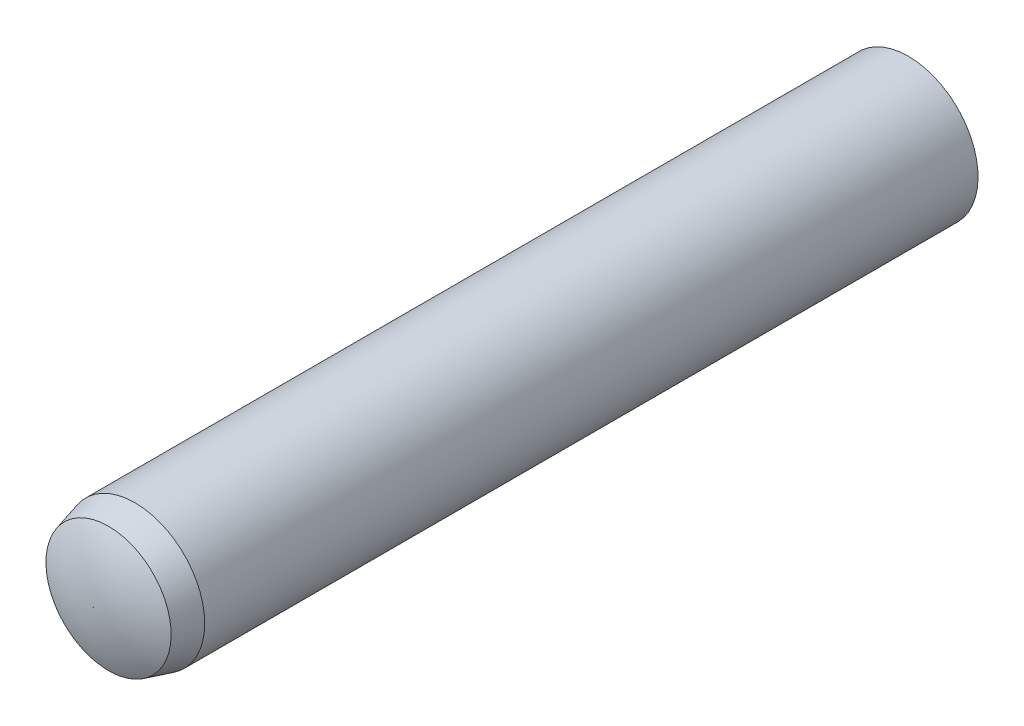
ISO-10303-21;
HEADER;
FILE_DESCRIPTION(('STEP AP214'),'2;1');
FILE_NAME('part.step','',(''),(''),'','','');
FILE_SCHEMA(('AUTOMOTIVE_DESIGN { 1 0 10303 214 1 1 1 1 }'));
ENDSEC;
DATA;
#1=APPLICATION_CONTEXT('core data for automotive mechanical design processes');
#2=APPLICATION_PROTOCOL_DEFINITION('international standard','automotive_design',2000,#1);
#3=PRODUCT_CONTEXT('',#1,'mechanical');
#4=PRODUCT('Part','Part','',(#3));
#5=PRODUCT_RELATED_PRODUCT_CATEGORY('part','',(#4));
#6=PRODUCT_DEFINITION_FORMATION('','',#4);
#7=PRODUCT_DEFINITION_CONTEXT('part definition',#1,'design');
#8=PRODUCT_DEFINITION('design','',#6,#7);
#9=PRODUCT_DEFINITION_SHAPE('','',#8);
#10=(LENGTH_UNIT() NAMED_UNIT(*) SI_UNIT(.MILLI.,.METRE.));
#11=(NAMED_UNIT(*) PLANE_ANGLE_UNIT() SI_UNIT($,.RADIAN.));
#12=(NAMED_UNIT(*) SI_UNIT($,.STERADIAN.) SOLID_ANGLE_UNIT());
#13=UNCERTAINTY_MEASURE_WITH_UNIT(LENGTH_MEASURE(1.E-05),#10,'distance_accuracy_value','');
#14=(GEOMETRIC_REPRESENTATION_CONTEXT(3) GLOBAL_UNCERTAINTY_ASSIGNED_CONTEXT((#13)) GLOBAL_UNIT_ASSIGNED_CONTEXT((#10,
#11,#12)) REPRESENTATION_CONTEXT('',''));
#15=CARTESIAN_POINT('',(0.,0.,0.));
#16=DIRECTION('',(0.,0.,1.));
#17=DIRECTION('',(1.,0.,0.));
#18=AXIS2_PLACEMENT_3D('',#15,#16,#17);
#19=CARTESIAN_POINT('',(0.,0.,30.));
#20=DIRECTION('',(0.,0.,-1.));
#21=DIRECTION('',(-1.,0.,0.));
#22=AXIS2_PLACEMENT_3D('',#19,#20,#21);
#23=CYLINDRICAL_SURFACE('',#22,5.);
#24=CARTESIAN_POINT('',(0.,0.,27.));
#25=DIRECTION('',(0.,0.,1.));
#26=DIRECTION('',(1.,0.,0.));
#27=AXIS2_PLACEMENT_3D('',#24,#25,#26);
#28=CIRCLE('',#27,5.);
#29=CARTESIAN_POINT('',(5.,0.,27.));
#30=VERTEX_POINT('',#29);
#31=EDGE_CURVE('E10',#30,#30,#28,.F.);
#32=ORIENTED_EDGE('',*,*,#31,.T.);
#33=EDGE_LOOP('',(#32));
#34=FACE_BOUND('',#33,.T.);
#35=CARTESIAN_POINT('',(0.,0.,-28.5));
#36=DIRECTION('',(0.,0.,1.));
#37=DIRECTION('',(1.,0.,0.));
#38=AXIS2_PLACEMENT_3D('',#35,#36,#37);
#39=CIRCLE('',#38,5.);
#40=CARTESIAN_POINT('',(0.,5.,-28.5));
#41=VERTEX_POINT('',#40);
#42=EDGE_CURVE('E368',#41,#41,#39,.T.);
#43=ORIENTED_EDGE('',*,*,#42,.T.);
#44=EDGE_LOOP('',(#43));
#45=FACE_BOUND('',#44,.T.);
#46=ADVANCED_FACE('F346',(#34,#45),#23,.T.);
#47=CARTESIAN_POINT('',(0.,0.,30.));
#48=DIRECTION('',(0.,0.,-1.));
#49=DIRECTION('',(-1.,0.,0.));
#50=AXIS2_PLACEMENT_3D('',#47,#48,#49);
#51=CONICAL_SURFACE('',#50,4.19615242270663,0.261799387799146);
#52=ORIENTED_EDGE('',*,*,#31,.F.);
#53=EDGE_LOOP('',(#52));
#54=FACE_BOUND('',#53,.T.);
#55=CARTESIAN_POINT('',(0.,0.,28.9));
#56=DIRECTION('',(0.,0.,1.));
#57=DIRECTION('',(1.,0.,0.));
#58=AXIS2_PLACEMENT_3D('',#55,#56,#57);
#59=CIRCLE('',#58,4.49089653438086);
#60=CARTESIAN_POINT('',(0.,4.49089653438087,28.9));
#61=VERTEX_POINT('',#60);
#62=EDGE_CURVE('E358',#61,#61,#59,.T.);
#63=ORIENTED_EDGE('',*,*,#62,.F.);
#64=EDGE_LOOP('',(#63));
#65=FACE_BOUND('',#64,.T.);
#66=ADVANCED_FACE('F390',(#54,#65),#51,.T.);
#67=CARTESIAN_POINT('',(0.,0.,19.9651329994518));
#68=DIRECTION('',(0.,0.,1.));
#69=DIRECTION('',(0.,1.,0.));
#70=AXIS2_PLACEMENT_3D('',#67,#68,#69);
#71=SPHERICAL_SURFACE('',#70,10.);
#72=CARTESIAN_POINT('',(0.,0.,29.9651317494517));
#73=DIRECTION('',(0.,0.,1.));
#74=DIRECTION('',(1.,0.,0.));
#75=AXIS2_PLACEMENT_3D('',#72,#73,#74);
#76=CIRCLE('',#75,0.00499999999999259);
#77=CARTESIAN_POINT('',(0.,0.00499999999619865,29.9651317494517));
#78=VERTEX_POINT('',#77);
#79=EDGE_CURVE('E362',#78,#78,#76,.T.);
#80=CARTESIAN_POINT('',(0.,4.49089653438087,28.9));
#81=CARTESIAN_POINT('',(0.,4.44759536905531,28.9217643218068));
#82=CARTESIAN_POINT('',(0.,4.40413596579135,28.9432138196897));
#83=CARTESIAN_POINT('',(0.,4.31690992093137,28.9854787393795));
#84=CARTESIAN_POINT('',(0.,4.27314327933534,29.0062941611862));
#85=CARTESIAN_POINT('',(0.,4.18531199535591,29.0472865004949));
#86=CARTESIAN_POINT('',(0.,4.14124735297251,29.0674634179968));
#87=CARTESIAN_POINT('',(0.,4.05282938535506,29.1071744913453));
#88=CARTESIAN_POINT('',(0.,4.00847606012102,29.126708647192));
#89=CARTESIAN_POINT('',(0.,3.91949010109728,29.1651300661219));
#90=CARTESIAN_POINT('',(0.,3.87485746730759,29.1840173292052));
#91=CARTESIAN_POINT('',(0.,3.78532232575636,29.221140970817));
#92=CARTESIAN_POINT('',(0.,3.74041981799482,29.2393773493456));
#93=CARTESIAN_POINT('',(0.,3.65035441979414,29.2751953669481));
#94=CARTESIAN_POINT('',(0.,3.605191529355,29.2927770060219));
#95=CARTESIAN_POINT('',(0.,3.51461491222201,29.3272818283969));
#96=CARTESIAN_POINT('',(0.,3.46920118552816,29.344205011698));
#97=CARTESIAN_POINT('',(0.,3.37813249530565,29.3773893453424));
#98=CARTESIAN_POINT('',(0.,3.332477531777,29.3936504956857));
#99=CARTESIAN_POINT('',(0.,3.24093601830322,29.4255073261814));
#100=CARTESIAN_POINT('',(0.,3.19504946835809,29.4411030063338));
#101=CARTESIAN_POINT('',(0.,3.10305448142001,29.4716255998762));
#102=CARTESIAN_POINT('',(0.,3.05694604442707,29.4865525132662));
#103=CARTESIAN_POINT('',(0.,2.96451702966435,29.5157344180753));
#104=CARTESIAN_POINT('',(0.,2.91819645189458,29.5299894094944));
#105=CARTESIAN_POINT('',(0.,2.82535294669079,29.557824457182));
#106=CARTESIAN_POINT('',(0.,2.77883001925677,29.5714045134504));
#107=CARTESIAN_POINT('',(0.,2.68559164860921,29.5978868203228));
#108=CARTESIAN_POINT('',(0.,2.63887620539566,29.6107890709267));
#109=CARTESIAN_POINT('',(0.,2.54526267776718,29.6359130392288));
#110=CARTESIAN_POINT('',(0.,2.49836459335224,29.648134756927));
#111=CARTESIAN_POINT('',(0.,2.40439569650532,29.6718950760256));
#112=CARTESIAN_POINT('',(0.,2.35732488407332,29.6834336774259));
#113=CARTESIAN_POINT('',(0.,2.26302048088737,29.705825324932));
#114=CARTESIAN_POINT('',(0.,2.2157868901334,29.7166783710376));
#115=CARTESIAN_POINT('',(0.,2.1211669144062,29.737696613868));
#116=CARTESIAN_POINT('',(0.,2.07378052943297,29.7478618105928));
#117=CARTESIAN_POINT('',(0.,1.97886498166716,29.767502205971));
#118=CARTESIAN_POINT('',(0.,1.93133581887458,29.7769774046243));
#119=CARTESIAN_POINT('',(0.,1.83614476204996,29.7952358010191));
#120=CARTESIAN_POINT('',(0.,1.78848286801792,29.8040189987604));
#121=CARTESIAN_POINT('',(0.,1.69303642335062,29.8208915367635));
#122=CARTESIAN_POINT('',(0.,1.64525187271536,29.8289808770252));
#123=CARTESIAN_POINT('',(0.,1.54957021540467,29.8444639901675));
#124=CARTESIAN_POINT('',(0.,1.50167310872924,29.8518577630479));
#125=CARTESIAN_POINT('',(0.,1.40577646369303,29.8659481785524));
#126=CARTESIAN_POINT('',(0.,1.35777692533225,29.8726448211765));
#127=CARTESIAN_POINT('',(0.,1.2616855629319,29.8853395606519));
#128=CARTESIAN_POINT('',(0.,1.21359373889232,29.8913376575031));
#129=CARTESIAN_POINT('',(0.,1.11732797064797,29.9026340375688));
#130=CARTESIAN_POINT('',(0.,1.06915402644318,29.9079323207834));
#131=CARTESIAN_POINT('',(0.,0.972734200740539,29.9178279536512));
#132=CARTESIAN_POINT('',(0.,0.924488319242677,29.9224253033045));
#133=CARTESIAN_POINT('',(0.,0.827934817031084,29.9309180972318));
#134=CARTESIAN_POINT('',(0.,0.779627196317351,29.9348135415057));
#135=CARTESIAN_POINT('',(0.,0.682960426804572,29.9419017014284));
#136=CARTESIAN_POINT('',(0.,0.634601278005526,29.9450944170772));
#137=CARTESIAN_POINT('',(0.,0.537841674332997,29.9507764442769));
#138=CARTESIAN_POINT('',(0.,0.489441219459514,29.9532657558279));
#139=CARTESIAN_POINT('',(0.,0.392609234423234,29.9575404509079));
#140=CARTESIAN_POINT('',(0.,0.344177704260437,29.959325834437));
#141=CARTESIAN_POINT('',(0.,0.247293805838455,29.9621922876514));
#142=CARTESIAN_POINT('',(0.,0.19884143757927,29.9632733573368));
#143=CARTESIAN_POINT('',(0.,0.101926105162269,29.9647309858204));
#144=CARTESIAN_POINT('',(0.,0.0534631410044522,29.9651075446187));
#145=CARTESIAN_POINT('',(0.,0.00499999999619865,29.9651317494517));
#146=B_SPLINE_CURVE_WITH_KNOTS('',3,(#80,#81,#82,#83,#84,#85,#86,#87,#88,#89,#90,#91,#92,#93,
#94,#95,#96,#97,#98,#99,#100,#101,#102,#103,#104,#105,#106,#107,#108,#109,#110,#111,#112,#113,
#114,#115,#116,#117,#118,#119,#120,#121,#122,#123,#124,#125,#126,#127,#128,#129,#130,#131,#132,
#133,#134,#135,#136,#137,#138,#139,#140,#141,#142,#143,#144,#145),.UNSPECIFIED.,.F.,.F.,(4,2,2,
2,2,2,2,2,2,2,2,2,2,2,2,2,2,2,2,2,2,2,2,2,2,2,2,2,2,2,2,2,4),(0.,0.145388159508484,
0.290776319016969,0.436164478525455,0.58155263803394,0.726940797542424,0.87232895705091,
1.01771711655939,1.16310527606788,1.30849343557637,1.45388159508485,1.59926975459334,
1.74465791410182,1.89004607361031,2.03543423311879,2.18082239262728,2.32621055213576,
2.47159871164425,2.61698687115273,2.76237503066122,2.9077631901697,3.05315134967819,
3.19853950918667,3.34392766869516,3.48931582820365,3.63470398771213,3.78009214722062,
3.9254803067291,4.07086846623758,4.21625662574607,4.36164478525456,4.50703294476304,
4.65242110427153),.UNSPECIFIED.);
#147=EDGE_CURVE('BSEAM394',#61,#78,#146,.T.);
#148=ORIENTED_EDGE('',*,*,#62,.T.);
#149=ORIENTED_EDGE('',*,*,#79,.F.);
#150=ORIENTED_EDGE('',*,*,#147,.T.);
#151=ORIENTED_EDGE('',*,*,#147,.F.);
#152=EDGE_LOOP('',(#148,#150,#149,#151));
#153=FACE_BOUND('',#152,.T.);
#154=ADVANCED_FACE('F394',(#153),#71,.T.);
#155=CARTESIAN_POINT('',(0.,0.,6.23644298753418));
#156=DIRECTION('',(0.,0.,1.));
#157=DIRECTION('',(1.,0.,0.));
#158=AXIS2_PLACEMENT_3D('',#155,#156,#157);
#159=CYLINDRICAL_SURFACE('',#158,0.00499999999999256);
#160=CARTESIAN_POINT('',(0.,0.,30.));
#161=DIRECTION('',(0.,0.,1.));
#162=DIRECTION('',(1.,0.,0.));
#163=AXIS2_PLACEMENT_3D('',#160,#161,#162);
#164=CIRCLE('',#163,0.00499999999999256);
#165=CARTESIAN_POINT('',(0.00499999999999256,0.,30.));
#166=VERTEX_POINT('',#165);
#167=EDGE_CURVE('E353',#166,#166,#164,.T.);
#168=ORIENTED_EDGE('',*,*,#167,.F.);
#169=EDGE_LOOP('',(#168));
#170=FACE_BOUND('',#169,.T.);
#171=ORIENTED_EDGE('',*,*,#79,.T.);
#172=EDGE_LOOP('',(#171));
#173=FACE_BOUND('',#172,.T.);
#174=ADVANCED_FACE('F400',(#170,#173),#159,.T.);
#175=CARTESIAN_POINT('',(0.,0.,30.));
#176=DIRECTION('',(0.,0.,1.));
#177=DIRECTION('',(1.,0.,0.));
#178=AXIS2_PLACEMENT_3D('',#175,#176,#177);
#179=PLANE('',#178);
#180=ORIENTED_EDGE('',*,*,#167,.T.);
#181=EDGE_LOOP('',(#180));
#182=FACE_BOUND('',#181,.T.);
#183=ADVANCED_FACE('F385',(#182),#179,.T.);
#184=CARTESIAN_POINT('',(0.,0.,6.23644298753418));
#185=DIRECTION('',(0.,0.,1.));
#186=DIRECTION('',(1.,0.,0.));
#187=AXIS2_PLACEMENT_3D('',#184,#185,#186);
#188=CYLINDRICAL_SURFACE('',#187,0.00499999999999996);
#189=CARTESIAN_POINT('',(0.,0.,-29.8397447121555));
#190=DIRECTION('',(0.,0.,1.));
#191=DIRECTION('',(1.,0.,0.));
#192=AXIS2_PLACEMENT_3D('',#189,#190,#191);
#193=CIRCLE('',#192,0.00499999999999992);
#194=CARTESIAN_POINT('',(0.,0.00500000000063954,-29.8397447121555));
#195=VERTEX_POINT('',#194);
#196=EDGE_CURVE('E365',#195,#195,#193,.T.);
#197=ORIENTED_EDGE('',*,*,#196,.F.);
#198=EDGE_LOOP('',(#197));
#199=FACE_BOUND('',#198,.T.);
#200=CARTESIAN_POINT('',(0.,0.,-30.));
#201=DIRECTION('',(0.,0.,1.));
#202=DIRECTION('',(1.,0.,0.));
#203=AXIS2_PLACEMENT_3D('',#200,#201,#202);
#204=CIRCLE('',#203,0.00499999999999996);
#205=CARTESIAN_POINT('',(0.00499999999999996,0.,-30.));
#206=VERTEX_POINT('',#205);
#207=EDGE_CURVE('E349',#206,#206,#204,.T.);
#208=ORIENTED_EDGE('',*,*,#207,.T.);
#209=EDGE_LOOP('',(#208));
#210=FACE_BOUND('',#209,.T.);
#211=ADVANCED_FACE('F376',(#199,#210),#188,.T.);
#212=CARTESIAN_POINT('',(0.,0.,-19.8397459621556));
#213=DIRECTION('',(0.,0.,1.));
#214=DIRECTION('',(0.,1.,0.));
#215=AXIS2_PLACEMENT_3D('',#212,#213,#214);
#216=SPHERICAL_SURFACE('',#215,10.);
#217=CARTESIAN_POINT('',(0.,0.00500000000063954,-29.8397447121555));
#218=CARTESIAN_POINT('',(0.,0.0594894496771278,-29.8397175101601));
#219=CARTESIAN_POINT('',(0.,0.113978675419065,-29.8392448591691));
#220=CARTESIAN_POINT('',(0.,0.222942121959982,-29.8374089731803));
#221=CARTESIAN_POINT('',(0.,0.277416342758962,-29.8360457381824));
#222=CARTESIAN_POINT('',(0.,0.386335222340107,-29.8324289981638));
#223=CARTESIAN_POINT('',(0.,0.440779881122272,-29.830175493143));
#224=CARTESIAN_POINT('',(0.,0.549625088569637,-29.8247788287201));
#225=CARTESIAN_POINT('',(0.,0.604025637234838,-29.8216356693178));
#226=CARTESIAN_POINT('',(0.,0.712768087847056,-29.8144605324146));
#227=CARTESIAN_POINT('',(0.,0.767109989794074,-29.8104285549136));
#228=CARTESIAN_POINT('',(0.,0.875720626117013,-29.8014768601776));
#229=CARTESIAN_POINT('',(0.,0.929989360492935,-29.7965571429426));
#230=CARTESIAN_POINT('',(0.,1.03843916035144,-29.7858312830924));
#231=CARTESIAN_POINT('',(0.,1.09262022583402,-29.7800251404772));
#232=CARTESIAN_POINT('',(0.,1.20088021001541,-29.7675279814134));
#233=CARTESIAN_POINT('',(0.,1.25495912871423,-29.7608369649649));
#234=CARTESIAN_POINT('',(0.,1.36300036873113,-29.7465718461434));
#235=CARTESIAN_POINT('',(0.,1.41696269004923,-29.7389977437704));
#236=CARTESIAN_POINT('',(0.,1.52475631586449,-29.7229684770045));
#237=CARTESIAN_POINT('',(0.,1.57858762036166,-29.7145133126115));
#238=CARTESIAN_POINT('',(0.,1.68610482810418,-29.6967241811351));
#239=CARTESIAN_POINT('',(0.,1.73979073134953,-29.6873902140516));
#240=CARTESIAN_POINT('',(0.,1.84700279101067,-29.6678459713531));
#241=CARTESIAN_POINT('',(0.,1.90052894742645,-29.6576356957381));
#242=CARTESIAN_POINT('',(0.,2.00740721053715,-29.6363415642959));
#243=CARTESIAN_POINT('',(0.,2.06075931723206,-29.6252577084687));
#244=CARTESIAN_POINT('',(0.,2.16727522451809,-29.602219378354));
#245=CARTESIAN_POINT('',(0.,2.2204390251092,-29.5902649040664));
#246=CARTESIAN_POINT('',(0.,2.32656411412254,-29.5654885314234));
#247=CARTESIAN_POINT('',(0.,2.37952540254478,-29.5526666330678));
#248=CARTESIAN_POINT('',(0.,2.48523131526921,-29.5261588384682));
#249=CARTESIAN_POINT('',(0.,2.5379759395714,-29.5124729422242));
#250=CARTESIAN_POINT('',(0.,2.64323443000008,-29.4842408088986));
#251=CARTESIAN_POINT('',(0.,2.69574829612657,-29.4696945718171));
#252=CARTESIAN_POINT('',(0.,2.80053123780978,-29.4397456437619));
#253=CARTESIAN_POINT('',(0.,2.85280031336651,-29.4243429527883));
#254=CARTESIAN_POINT('',(0.,2.95707970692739,-29.3926852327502));
#255=CARTESIAN_POINT('',(0.,3.00909002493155,-29.3764302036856));
#256=CARTESIAN_POINT('',(0.,3.11283800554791,-29.3430721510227));
#257=CARTESIAN_POINT('',(0.,3.16457566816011,-29.3259691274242));
#258=CARTESIAN_POINT('',(0.,3.26776451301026,-29.2909196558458));
#259=CARTESIAN_POINT('',(0.,3.3192156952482,-29.2729732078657));
#260=CARTESIAN_POINT('',(0.,3.4218178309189,-29.2362416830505));
#261=CARTESIAN_POINT('',(0.,3.47296878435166,-29.2174566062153));
#262=CARTESIAN_POINT('',(0.,3.57495679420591,-29.1790528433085));
#263=CARTESIAN_POINT('',(0.,3.6257938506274,-29.1594341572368));
#264=CARTESIAN_POINT('',(0.,3.72714048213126,-29.1193684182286));
#265=CARTESIAN_POINT('',(0.,3.77765005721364,-29.098921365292));
#266=CARTESIAN_POINT('',(0.,3.87832822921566,-29.0572043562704));
#267=CARTESIAN_POINT('',(0.,3.9284968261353,-29.0359344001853));
#268=CARTESIAN_POINT('',(0.,4.02847963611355,-28.9925772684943));
#269=CARTESIAN_POINT('',(0.,4.07829384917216,-28.9704900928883));
#270=CARTESIAN_POINT('',(0.,4.17755458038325,-28.9255044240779));
#271=CARTESIAN_POINT('',(0.,4.22700109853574,-28.9026059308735));
#272=CARTESIAN_POINT('',(0.,4.32551322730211,-28.8560037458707));
#273=CARTESIAN_POINT('',(0.,4.37457883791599,-28.8323000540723));
#274=CARTESIAN_POINT('',(0.,4.47231604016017,-28.7840938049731));
#275=CARTESIAN_POINT('',(0.,4.52098763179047,-28.7595912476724));
#276=CARTESIAN_POINT('',(0.,4.61792379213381,-28.7097938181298));
#277=CARTESIAN_POINT('',(0.,4.66618836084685,-28.684498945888));
#278=CARTESIAN_POINT('',(0.,4.76229757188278,-28.633123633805));
#279=CARTESIAN_POINT('',(0.,4.81014221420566,-28.6070431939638));
#280=CARTESIAN_POINT('',(0.,4.90539881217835,-28.5541037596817));
#281=CARTESIAN_POINT('',(0.,4.95281076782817,-28.5272447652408));
#282=CARTESIAN_POINT('',(0.,5.,-28.5));
#283=B_SPLINE_CURVE_WITH_KNOTS('',3,(#217,#218,#219,#220,#221,#222,#223,#224,#225,#226,#227,
#228,#229,#230,#231,#232,#233,#234,#235,#236,#237,#238,#239,#240,#241,#242,#243,#244,#245,#246,
#247,#248,#249,#250,#251,#252,#253,#254,#255,#256,#257,#258,#259,#260,#261,#262,#263,#264,#265,
#266,#267,#268,#269,#270,#271,#272,#273,#274,#275,#276,#277,#278,#279,#280,#281,#282),
.UNSPECIFIED.,.F.,.F.,(4,2,2,2,2,2,2,2,2,2,2,2,2,2,2,2,2,2,2,2,2,2,2,2,2,2,2,2,2,2,2,2,4),(0.,
0.163466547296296,0.326933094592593,0.490399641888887,0.653866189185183,0.817332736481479,
0.980799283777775,1.14426583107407,1.30773237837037,1.47119892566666,1.63466547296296,
1.79813202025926,1.96159856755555,2.12506511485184,2.28853166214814,2.45199820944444,
2.61546475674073,2.77893130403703,2.94239785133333,3.10586439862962,3.26933094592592,
3.43279749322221,3.59626404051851,3.75973058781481,3.9231971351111,4.0866636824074,
4.25013022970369,4.41359677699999,4.57706332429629,4.74052987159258,4.90399641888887,
5.06746296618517,5.23092951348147),.UNSPECIFIED.);
#284=EDGE_CURVE('BSEAM373',#195,#41,#283,.T.);
#285=ORIENTED_EDGE('',*,*,#196,.T.);
#286=ORIENTED_EDGE('',*,*,#42,.F.);
#287=ORIENTED_EDGE('',*,*,#284,.T.);
#288=ORIENTED_EDGE('',*,*,#284,.F.);
#289=EDGE_LOOP('',(#285,#287,#286,#288));
#290=FACE_BOUND('',#289,.T.);
#291=ADVANCED_FACE('F373',(#290),#216,.T.);
#292=CARTESIAN_POINT('',(0.,0.,-30.));
#293=DIRECTION('',(0.,0.,1.));
#294=DIRECTION('',(1.,0.,0.));
#295=AXIS2_PLACEMENT_3D('',#292,#293,#294);
#296=PLANE('',#295);
#297=ORIENTED_EDGE('',*,*,#207,.F.);
#298=EDGE_LOOP('',(#297));
#299=FACE_BOUND('',#298,.T.);
#300=ADVANCED_FACE('F375',(#299),#296,.F.);
#301=CLOSED_SHELL('',(#46,#66,#154,#174,#183,#211,#291,#300));
#302=MANIFOLD_SOLID_BREP('B2',#301);
#303=ADVANCED_BREP_SHAPE_REPRESENTATION('',(#18,#302),#14);
#304=SHAPE_DEFINITION_REPRESENTATION(#9,#303);
ENDSEC;
END-ISO-10303-21;
